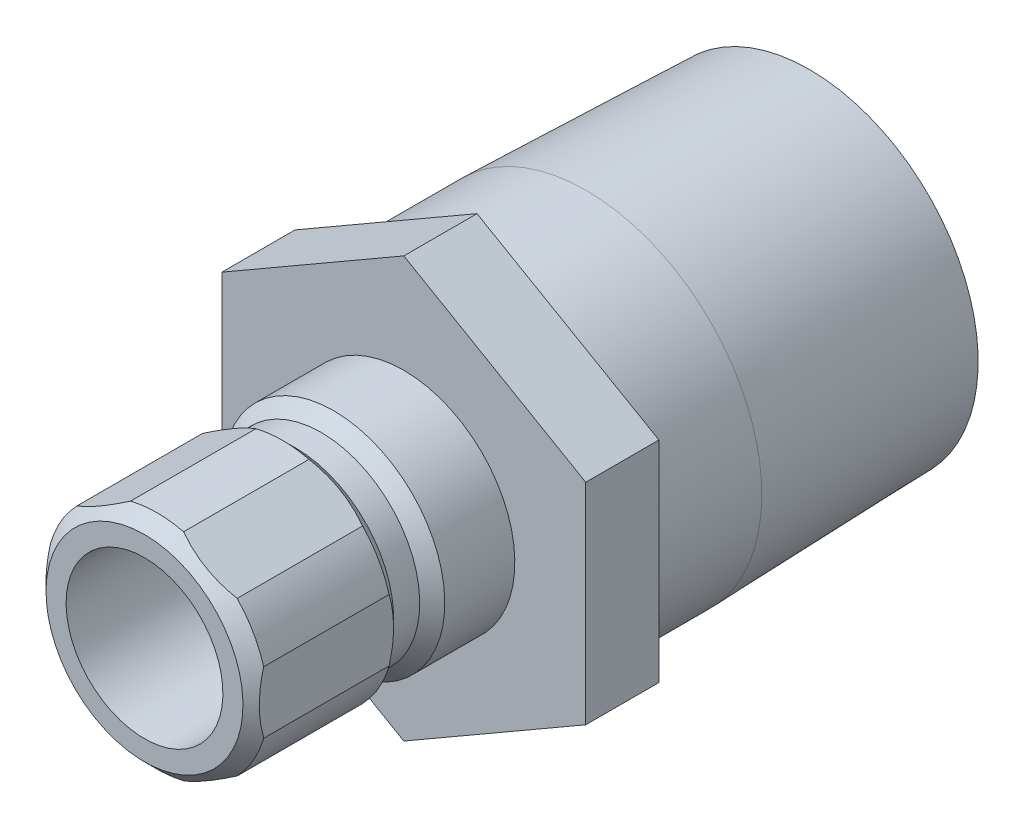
ISO-10303-21;
HEADER;
FILE_DESCRIPTION(('STEP AP214'),'2;1');
FILE_NAME('part.step','',(''),(''),'','','');
FILE_SCHEMA(('AUTOMOTIVE_DESIGN { 1 0 10303 214 1 1 1 1 }'));
ENDSEC;
DATA;
#1=APPLICATION_CONTEXT('core data for automotive mechanical design processes');
#2=APPLICATION_PROTOCOL_DEFINITION('international standard','automotive_design',2000,#1);
#3=PRODUCT_CONTEXT('',#1,'mechanical');
#4=PRODUCT('Part','Part','',(#3));
#5=PRODUCT_RELATED_PRODUCT_CATEGORY('part','',(#4));
#6=PRODUCT_DEFINITION_FORMATION('','',#4);
#7=PRODUCT_DEFINITION_CONTEXT('part definition',#1,'design');
#8=PRODUCT_DEFINITION('design','',#6,#7);
#9=PRODUCT_DEFINITION_SHAPE('','',#8);
#10=(LENGTH_UNIT() NAMED_UNIT(*) SI_UNIT(.MILLI.,.METRE.));
#11=(NAMED_UNIT(*) PLANE_ANGLE_UNIT() SI_UNIT($,.RADIAN.));
#12=(NAMED_UNIT(*) SI_UNIT($,.STERADIAN.) SOLID_ANGLE_UNIT());
#13=UNCERTAINTY_MEASURE_WITH_UNIT(LENGTH_MEASURE(1.E-05),#10,'distance_accuracy_value','');
#14=(GEOMETRIC_REPRESENTATION_CONTEXT(3) GLOBAL_UNCERTAINTY_ASSIGNED_CONTEXT((#13)) GLOBAL_UNIT_ASSIGNED_CONTEXT((#10,
#11,#12)) REPRESENTATION_CONTEXT('',''));
#15=CARTESIAN_POINT('',(0.,0.,0.));
#16=DIRECTION('',(0.,0.,1.));
#17=DIRECTION('',(1.,0.,0.));
#18=AXIS2_PLACEMENT_3D('',#15,#16,#17);
#19=CARTESIAN_POINT('',(0.,0.,0.));
#20=DIRECTION('',(0.,0.,-1.));
#21=DIRECTION('',(0.,1.,0.));
#22=AXIS2_PLACEMENT_3D('',#19,#20,#21);
#23=CYLINDRICAL_SURFACE('',#22,6.7437);
#24=DIRECTION('',(0.,0.,-1.));
#25=VECTOR('',#24,1.);
#26=CARTESIAN_POINT('',(-4.86468280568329,4.67036945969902,0.));
#27=LINE('',#26,#25);
#28=CARTESIAN_POINT('',(-4.86468280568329,4.67036945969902,7.36599999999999));
#29=VERTEX_POINT('',#28);
#30=CARTESIAN_POINT('',(-4.86468280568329,4.67036945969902,14.986));
#31=VERTEX_POINT('',#30);
#32=EDGE_CURVE('E526',#29,#31,#27,.F.);
#33=ORIENTED_EDGE('',*,*,#32,.F.);
#34=CARTESIAN_POINT('',(0.,0.,7.36599999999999));
#35=DIRECTION('',(0.,0.,-1.));
#36=DIRECTION('',(0.,1.,0.));
#37=AXIS2_PLACEMENT_3D('',#34,#35,#36);
#38=CIRCLE('',#37,6.7437);
#39=CARTESIAN_POINT('',(-6.477,1.87775416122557,7.36599999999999));
#40=VERTEX_POINT('',#39);
#41=EDGE_CURVE('E188',#40,#29,#38,.T.);
#42=ORIENTED_EDGE('',*,*,#41,.F.);
#43=DIRECTION('',(0.,0.,-1.));
#44=VECTOR('',#43,1.);
#45=CARTESIAN_POINT('',(-6.477,1.87775416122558,0.));
#46=LINE('',#45,#44);
#47=CARTESIAN_POINT('',(-6.477,1.87775416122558,14.986));
#48=VERTEX_POINT('',#47);
#49=EDGE_CURVE('E61',#48,#40,#46,.T.);
#50=ORIENTED_EDGE('',*,*,#49,.F.);
#51=CARTESIAN_POINT('',(0.,0.,14.986));
#52=DIRECTION('',(0.,0.,-1.));
#53=DIRECTION('',(0.,1.,0.));
#54=AXIS2_PLACEMENT_3D('',#51,#52,#53);
#55=CIRCLE('',#54,6.7437);
#56=EDGE_CURVE('E199',#48,#31,#55,.T.);
#57=ORIENTED_EDGE('',*,*,#56,.T.);
#58=EDGE_LOOP('',(#33,#42,#50,#57));
#59=FACE_BOUND('',#58,.T.);
#60=ADVANCED_FACE('F34',(#59),#23,.T.);
#61=DIRECTION('',(0.,0.,-1.));
#62=VECTOR('',#61,1.);
#63=CARTESIAN_POINT('',(-6.477,-1.87775416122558,0.));
#64=LINE('',#63,#62);
#65=CARTESIAN_POINT('',(-6.477,-1.87775416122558,7.36599999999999));
#66=VERTEX_POINT('',#65);
#67=CARTESIAN_POINT('',(-6.477,-1.87775416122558,14.986));
#68=VERTEX_POINT('',#67);
#69=EDGE_CURVE('E219',#66,#68,#64,.F.);
#70=ORIENTED_EDGE('',*,*,#69,.F.);
#71=CARTESIAN_POINT('',(-4.86468280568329,-4.67036945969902,7.36599999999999));
#72=VERTEX_POINT('',#71);
#73=EDGE_CURVE('E192',#72,#66,#38,.T.);
#74=ORIENTED_EDGE('',*,*,#73,.F.);
#75=DIRECTION('',(0.,0.,-1.));
#76=VECTOR('',#75,1.);
#77=CARTESIAN_POINT('',(-4.86468280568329,-4.67036945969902,0.));
#78=LINE('',#77,#76);
#79=CARTESIAN_POINT('',(-4.86468280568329,-4.67036945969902,14.986));
#80=VERTEX_POINT('',#79);
#81=EDGE_CURVE('E217',#80,#72,#78,.T.);
#82=ORIENTED_EDGE('',*,*,#81,.F.);
#83=EDGE_CURVE('E220',#80,#68,#55,.T.);
#84=ORIENTED_EDGE('',*,*,#83,.T.);
#85=EDGE_LOOP('',(#70,#74,#82,#84));
#86=FACE_BOUND('',#85,.T.);
#87=ADVANCED_FACE('F215',(#86),#23,.T.);
#88=DIRECTION('',(0.,0.,-1.));
#89=VECTOR('',#88,1.);
#90=CARTESIAN_POINT('',(-1.61231719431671,-6.5481236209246,0.));
#91=LINE('',#90,#89);
#92=CARTESIAN_POINT('',(-1.61231719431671,-6.5481236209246,7.36599999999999));
#93=VERTEX_POINT('',#92);
#94=CARTESIAN_POINT('',(-1.61231719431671,-6.5481236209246,14.986));
#95=VERTEX_POINT('',#94);
#96=EDGE_CURVE('E298',#93,#95,#91,.F.);
#97=ORIENTED_EDGE('',*,*,#96,.F.);
#98=CARTESIAN_POINT('',(1.61231719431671,-6.5481236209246,7.36599999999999));
#99=VERTEX_POINT('',#98);
#100=EDGE_CURVE('E202',#99,#93,#38,.T.);
#101=ORIENTED_EDGE('',*,*,#100,.F.);
#102=DIRECTION('',(0.,0.,-1.));
#103=VECTOR('',#102,1.);
#104=CARTESIAN_POINT('',(1.61231719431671,-6.5481236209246,0.));
#105=LINE('',#104,#103);
#106=CARTESIAN_POINT('',(1.61231719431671,-6.5481236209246,14.986));
#107=VERTEX_POINT('',#106);
#108=EDGE_CURVE('E315',#107,#99,#105,.T.);
#109=ORIENTED_EDGE('',*,*,#108,.F.);
#110=EDGE_CURVE('E311',#107,#95,#55,.T.);
#111=ORIENTED_EDGE('',*,*,#110,.T.);
#112=EDGE_LOOP('',(#97,#101,#109,#111));
#113=FACE_BOUND('',#112,.T.);
#114=ADVANCED_FACE('F314',(#113),#23,.T.);
#115=DIRECTION('',(0.,0.,-1.));
#116=VECTOR('',#115,1.);
#117=CARTESIAN_POINT('',(4.8646828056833,-4.67036945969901,0.));
#118=LINE('',#117,#116);
#119=CARTESIAN_POINT('',(4.8646828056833,-4.67036945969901,7.36599999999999));
#120=VERTEX_POINT('',#119);
#121=CARTESIAN_POINT('',(4.8646828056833,-4.67036945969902,14.986));
#122=VERTEX_POINT('',#121);
#123=EDGE_CURVE('E295',#120,#122,#118,.F.);
#124=ORIENTED_EDGE('',*,*,#123,.F.);
#125=CARTESIAN_POINT('',(6.477,-1.87775416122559,7.36599999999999));
#126=VERTEX_POINT('',#125);
#127=EDGE_CURVE('E197',#126,#120,#38,.T.);
#128=ORIENTED_EDGE('',*,*,#127,.F.);
#129=DIRECTION('',(0.,0.,-1.));
#130=VECTOR('',#129,1.);
#131=CARTESIAN_POINT('',(6.477,-1.8777541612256,0.));
#132=LINE('',#131,#130);
#133=CARTESIAN_POINT('',(6.477,-1.8777541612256,14.986));
#134=VERTEX_POINT('',#133);
#135=EDGE_CURVE('E362',#134,#126,#132,.T.);
#136=ORIENTED_EDGE('',*,*,#135,.F.);
#137=EDGE_CURVE('E316',#134,#122,#55,.T.);
#138=ORIENTED_EDGE('',*,*,#137,.T.);
#139=EDGE_LOOP('',(#124,#128,#136,#138));
#140=FACE_BOUND('',#139,.T.);
#141=ADVANCED_FACE('F349',(#140),#23,.T.);
#142=DIRECTION('',(0.,0.,-1.));
#143=VECTOR('',#142,1.);
#144=CARTESIAN_POINT('',(6.477,1.8777541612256,0.));
#145=LINE('',#144,#143);
#146=CARTESIAN_POINT('',(6.477,1.87775416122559,7.36599999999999));
#147=VERTEX_POINT('',#146);
#148=CARTESIAN_POINT('',(6.477,1.87775416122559,14.986));
#149=VERTEX_POINT('',#148);
#150=EDGE_CURVE('E357',#147,#149,#145,.F.);
#151=ORIENTED_EDGE('',*,*,#150,.F.);
#152=CARTESIAN_POINT('',(4.86468280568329,4.67036945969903,7.36599999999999));
#153=VERTEX_POINT('',#152);
#154=EDGE_CURVE('E191',#153,#147,#38,.T.);
#155=ORIENTED_EDGE('',*,*,#154,.F.);
#156=DIRECTION('',(0.,0.,-1.));
#157=VECTOR('',#156,1.);
#158=CARTESIAN_POINT('',(4.86468280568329,4.67036945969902,0.));
#159=LINE('',#158,#157);
#160=CARTESIAN_POINT('',(4.86468280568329,4.67036945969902,14.986));
#161=VERTEX_POINT('',#160);
#162=EDGE_CURVE('E168',#161,#153,#159,.T.);
#163=ORIENTED_EDGE('',*,*,#162,.F.);
#164=EDGE_CURVE('E200',#161,#149,#55,.T.);
#165=ORIENTED_EDGE('',*,*,#164,.T.);
#166=EDGE_LOOP('',(#151,#155,#163,#165));
#167=FACE_BOUND('',#166,.T.);
#168=ADVANCED_FACE('F334',(#167),#23,.T.);
#169=CARTESIAN_POINT('',(0.,0.,0.));
#170=DIRECTION('',(0.,0.,-1.));
#171=DIRECTION('',(0.,1.,0.));
#172=AXIS2_PLACEMENT_3D('',#169,#170,#171);
#173=CYLINDRICAL_SURFACE('',#172,10.668);
#174=CARTESIAN_POINT('',(0.,0.,-11.0744));
#175=DIRECTION('',(0.,0.,-1.));
#176=DIRECTION('',(0.,1.,0.));
#177=AXIS2_PLACEMENT_3D('',#174,#175,#176);
#178=CIRCLE('',#177,10.668);
#179=CARTESIAN_POINT('',(0.,10.668,-11.0744));
#180=VERTEX_POINT('',#179);
#181=EDGE_CURVE('E455',#180,#180,#178,.T.);
#182=ORIENTED_EDGE('',*,*,#181,.F.);
#183=EDGE_LOOP('',(#182));
#184=FACE_BOUND('',#183,.T.);
#185=CARTESIAN_POINT('',(0.,0.,-4.445));
#186=DIRECTION('',(0.,0.,1.));
#187=DIRECTION('',(1.,0.,0.));
#188=AXIS2_PLACEMENT_3D('',#185,#186,#187);
#189=CIRCLE('',#188,10.668);
#190=CARTESIAN_POINT('',(10.668,0.,-4.445));
#191=VERTEX_POINT('',#190);
#192=EDGE_CURVE('E471',#191,#191,#189,.F.);
#193=ORIENTED_EDGE('',*,*,#192,.T.);
#194=EDGE_LOOP('',(#193));
#195=FACE_BOUND('',#194,.T.);
#196=ADVANCED_FACE('F328',(#184,#195),#173,.T.);
#197=CARTESIAN_POINT('',(0.,0.,0.));
#198=DIRECTION('',(0.,0.,-1.));
#199=DIRECTION('',(0.,1.,0.));
#200=AXIS2_PLACEMENT_3D('',#197,#198,#199);
#201=CYLINDRICAL_SURFACE('',#200,4.7625);
#202=CARTESIAN_POINT('',(0.,0.,-1.524));
#203=DIRECTION('',(0.,0.,-1.));
#204=DIRECTION('',(0.,1.,0.));
#205=AXIS2_PLACEMENT_3D('',#202,#203,#204);
#206=CIRCLE('',#205,4.7625);
#207=CARTESIAN_POINT('',(0.,4.7625,-1.524));
#208=VERTEX_POINT('',#207);
#209=EDGE_CURVE('E469',#208,#208,#206,.T.);
#210=ORIENTED_EDGE('',*,*,#209,.T.);
#211=EDGE_LOOP('',(#210));
#212=FACE_BOUND('',#211,.T.);
#213=CARTESIAN_POINT('',(0.,0.,15.748));
#214=DIRECTION('',(0.,0.,-1.));
#215=DIRECTION('',(0.,1.,0.));
#216=AXIS2_PLACEMENT_3D('',#213,#214,#215);
#217=CIRCLE('',#216,4.7625);
#218=CARTESIAN_POINT('',(0.,4.7625,15.748));
#219=VERTEX_POINT('',#218);
#220=EDGE_CURVE('E174',#219,#219,#217,.T.);
#221=ORIENTED_EDGE('',*,*,#220,.F.);
#222=EDGE_LOOP('',(#221));
#223=FACE_BOUND('',#222,.T.);
#224=ADVANCED_FACE('F36',(#212,#223),#201,.F.);
#225=CARTESIAN_POINT('',(0.,4.7625,15.748));
#226=DIRECTION('',(0.,0.,1.));
#227=DIRECTION('',(0.,-1.,0.));
#228=AXIS2_PLACEMENT_3D('',#225,#226,#227);
#229=PLANE('',#228);
#230=ORIENTED_EDGE('',*,*,#220,.T.);
#231=EDGE_LOOP('',(#230));
#232=FACE_BOUND('',#231,.T.);
#233=CARTESIAN_POINT('',(0.,0.,15.748));
#234=DIRECTION('',(0.,0.,-1.));
#235=DIRECTION('',(0.,1.,0.));
#236=AXIS2_PLACEMENT_3D('',#233,#234,#235);
#237=CIRCLE('',#236,5.9817);
#238=CARTESIAN_POINT('',(0.,5.9817,15.748));
#239=VERTEX_POINT('',#238);
#240=EDGE_CURVE('E319',#239,#239,#237,.T.);
#241=ORIENTED_EDGE('',*,*,#240,.F.);
#242=EDGE_LOOP('',(#241));
#243=FACE_BOUND('',#242,.T.);
#244=ADVANCED_FACE('F324',(#232,#243),#229,.T.);
#245=CARTESIAN_POINT('',(0.,0.,14.986));
#246=DIRECTION('',(0.,0.,-1.));
#247=DIRECTION('',(0.,1.,0.));
#248=AXIS2_PLACEMENT_3D('',#245,#246,#247);
#249=CONICAL_SURFACE('',#248,6.7437,0.785398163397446);
#250=CARTESIAN_POINT('',(-4.86530473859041,4.67001038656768,14.9858));
#251=CARTESIAN_POINT('',(-4.72486305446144,4.75109443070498,15.0310202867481));
#252=CARTESIAN_POINT('',(-4.58312979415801,4.83292416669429,15.0711660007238));
#253=CARTESIAN_POINT('',(-4.29751110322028,4.99782619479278,15.1402365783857));
#254=CARTESIAN_POINT('',(-4.15362394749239,5.0808994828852,15.1691518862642));
#255=CARTESIAN_POINT('',(-3.8673393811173,5.2461859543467,15.2141425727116));
#256=CARTESIAN_POINT('',(-3.7249720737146,5.32838175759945,15.2304694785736));
#257=CARTESIAN_POINT('',(-3.43963286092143,5.49312242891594,15.2506210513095));
#258=CARTESIAN_POINT('',(-3.29666126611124,5.57566711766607,15.2544515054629));
#259=CARTESIAN_POINT('',(-3.02472390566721,5.73267022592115,15.2497120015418));
#260=CARTESIAN_POINT('',(-2.89574173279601,5.807138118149,15.2423062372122));
#261=CARTESIAN_POINT('',(-2.63846984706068,5.95567411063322,15.2174303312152));
#262=CARTESIAN_POINT('',(-2.51018036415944,6.02974207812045,15.1999570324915));
#263=CARTESIAN_POINT('',(-2.25244237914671,6.17854717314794,15.1550584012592));
#264=CARTESIAN_POINT('',(-2.1230180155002,6.25327036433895,15.1274506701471));
#265=CARTESIAN_POINT('',(-1.86594955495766,6.40168890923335,15.0631944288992));
#266=CARTESIAN_POINT('',(-1.73830430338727,6.47538492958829,15.026552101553));
#267=CARTESIAN_POINT('',(-1.61169526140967,6.5484826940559,14.9858));
#268=B_SPLINE_CURVE_WITH_KNOTS('',3,(#250,#251,#252,#253,#254,#255,#256,#257,#258,#259,#260,
#261,#262,#263,#264,#265,#266,#267),.UNSPECIFIED.,.F.,.F.,(4,2,2,2,2,2,2,2,4),(0.,
0.505093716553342,1.01061627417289,1.50575564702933,2.00066568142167,2.4476800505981,
2.89483467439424,3.35046683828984,3.80578805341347),.UNSPECIFIED.);
#269=CARTESIAN_POINT('',(-1.61231719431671,6.5481236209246,14.986));
#270=VERTEX_POINT('',#269);
#271=EDGE_CURVE('E506',#31,#270,#268,.T.);
#272=ORIENTED_EDGE('',*,*,#271,.F.);
#273=ORIENTED_EDGE('',*,*,#56,.F.);
#274=CARTESIAN_POINT('',(-6.477,-7.31595245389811,11.9585849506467));
#275=CARTESIAN_POINT('',(-6.477,-7.1371619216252,12.09242068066));
#276=CARTESIAN_POINT('',(-6.477,-6.95735466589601,12.2249205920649));
#277=CARTESIAN_POINT('',(-6.477,-6.59531185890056,12.4866559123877));
#278=CARTESIAN_POINT('',(-6.477,-6.41307569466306,12.6158904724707));
#279=CARTESIAN_POINT('',(-6.477,-6.04444818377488,12.8714195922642));
#280=CARTESIAN_POINT('',(-6.477,-5.85803557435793,12.9976835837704));
#281=CARTESIAN_POINT('',(-6.477,-5.48202253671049,13.245356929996));
#282=CARTESIAN_POINT('',(-6.477,-5.29242233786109,13.3667666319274));
#283=CARTESIAN_POINT('',(-6.477,-4.8990824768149,13.6101330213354));
#284=CARTESIAN_POINT('',(-6.477,-4.69513615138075,13.7317573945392));
#285=CARTESIAN_POINT('',(-6.477,-4.2824994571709,13.9668032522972));
#286=CARTESIAN_POINT('',(-6.477,-4.07380836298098,14.0802234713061));
#287=CARTESIAN_POINT('',(-6.477,-3.65173370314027,14.2964010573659));
#288=CARTESIAN_POINT('',(-6.477,-3.43836632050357,14.3991897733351));
#289=CARTESIAN_POINT('',(-6.477,-3.00590599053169,14.59180459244));
#290=CARTESIAN_POINT('',(-6.477,-2.78681563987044,14.6816364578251));
#291=CARTESIAN_POINT('',(-6.477,-2.35869152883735,14.8392509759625));
#292=CARTESIAN_POINT('',(-6.477,-2.15007621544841,14.9081583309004));
#293=CARTESIAN_POINT('',(-6.477,-1.72794730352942,15.029215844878));
#294=CARTESIAN_POINT('',(-6.477,-1.51443335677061,15.0813648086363));
#295=CARTESIAN_POINT('',(-6.477,-1.08726616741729,15.1653541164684));
#296=CARTESIAN_POINT('',(-6.477,-0.873680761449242,15.1975339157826));
#297=CARTESIAN_POINT('',(-6.477,-0.444382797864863,15.2409825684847));
#298=CARTESIAN_POINT('',(-6.477,-0.228670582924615,15.2522547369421));
#299=CARTESIAN_POINT('',(-6.477,0.195590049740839,15.2531049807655));
#300=CARTESIAN_POINT('',(-6.477,0.40413733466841,15.2433943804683));
#301=CARTESIAN_POINT('',(-6.477,0.819375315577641,15.2043531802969));
#302=CARTESIAN_POINT('',(-6.477,1.026065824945,15.1750206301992));
#303=CARTESIAN_POINT('',(-6.477,1.43958683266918,15.0978125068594));
#304=CARTESIAN_POINT('',(-6.477,1.64635839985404,15.0496261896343));
#305=CARTESIAN_POINT('',(-6.477,2.05541277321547,14.9372378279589));
#306=CARTESIAN_POINT('',(-6.477,2.25769600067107,14.8730372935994));
#307=CARTESIAN_POINT('',(-6.477,2.67942290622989,14.7234325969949));
#308=CARTESIAN_POINT('',(-6.477,2.89830973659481,14.6364736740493));
#309=CARTESIAN_POINT('',(-6.477,3.33036785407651,14.4492510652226));
#310=CARTESIAN_POINT('',(-6.477,3.5435363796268,14.3489810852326));
#311=CARTESIAN_POINT('',(-6.477,3.96521765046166,14.1375266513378));
#312=CARTESIAN_POINT('',(-6.477,4.17371291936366,14.026307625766));
#313=CARTESIAN_POINT('',(-6.477,4.58589470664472,13.7954185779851));
#314=CARTESIAN_POINT('',(-6.477,4.78958199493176,13.6757499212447));
#315=CARTESIAN_POINT('',(-6.477,5.18271200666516,13.4357848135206));
#316=CARTESIAN_POINT('',(-6.477,5.37235766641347,13.3158190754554));
#317=CARTESIAN_POINT('',(-6.477,5.74839484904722,13.0708760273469));
#318=CARTESIAN_POINT('',(-6.477,5.93478612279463,12.9458983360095));
#319=CARTESIAN_POINT('',(-6.477,6.30322303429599,12.6928680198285));
#320=CARTESIAN_POINT('',(-6.477,6.48529173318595,12.5648488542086));
#321=CARTESIAN_POINT('',(-6.477,6.84694630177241,12.3054498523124));
#322=CARTESIAN_POINT('',(-6.477,7.02653283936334,12.174070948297));
#323=CARTESIAN_POINT('',(-6.477,7.20508094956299,12.041319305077));
#324=B_SPLINE_CURVE_WITH_KNOTS('',3,(#274,#275,#276,#277,#278,#279,#280,#281,#282,#283,#284,
#285,#286,#287,#288,#289,#290,#291,#292,#293,#294,#295,#296,#297,#298,#299,#300,#301,#302,#303,
#304,#305,#306,#307,#308,#309,#310,#311,#312,#313,#314,#315,#316,#317,#318,#319,#320,#321,#322,
#323),.UNSPECIFIED.,.F.,.F.,(4,2,2,2,2,2,2,2,2,2,2,2,2,2,2,2,2,2,2,2,2,2,2,2,4),(0.,
0.670015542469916,1.34020350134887,2.01558827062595,2.69092464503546,3.40314702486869,
4.11547903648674,4.82564684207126,5.53549783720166,6.19401709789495,6.85258331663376,
7.49962373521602,8.14656155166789,8.77191276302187,9.39732613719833,10.0335138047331,
10.6696415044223,11.3756703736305,12.0820342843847,12.7907048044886,13.4992610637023,
14.1723809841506,14.845552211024,15.5132243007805,16.1807130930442),.UNSPECIFIED.);
#325=EDGE_CURVE('E222',#68,#48,#324,.T.);
#326=ORIENTED_EDGE('',*,*,#325,.F.);
#327=ORIENTED_EDGE('',*,*,#83,.F.);
#328=CARTESIAN_POINT('',(-1.61169526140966,-6.5484826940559,14.9858));
#329=CARTESIAN_POINT('',(-1.75213694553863,-6.4673986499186,15.0310202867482));
#330=CARTESIAN_POINT('',(-1.89387020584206,-6.38556891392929,15.0711660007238));
#331=CARTESIAN_POINT('',(-2.1794888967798,-6.2206668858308,15.1402365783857));
#332=CARTESIAN_POINT('',(-2.32337605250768,-6.13759359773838,15.1691518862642));
#333=CARTESIAN_POINT('',(-2.60966061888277,-5.97230712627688,15.2141425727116));
#334=CARTESIAN_POINT('',(-2.75202792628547,-5.89011132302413,15.2304694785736));
#335=CARTESIAN_POINT('',(-3.03736713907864,-5.72537065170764,15.2506210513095));
#336=CARTESIAN_POINT('',(-3.18033873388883,-5.64282596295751,15.2544515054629));
#337=CARTESIAN_POINT('',(-3.45227609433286,-5.48582285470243,15.2497120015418));
#338=CARTESIAN_POINT('',(-3.58125826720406,-5.41135496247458,15.2423062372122));
#339=CARTESIAN_POINT('',(-3.83853015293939,-5.26281896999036,15.2174303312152));
#340=CARTESIAN_POINT('',(-3.96681963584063,-5.18875100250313,15.1999570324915));
#341=CARTESIAN_POINT('',(-4.22455762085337,-5.03994590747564,15.1550584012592));
#342=CARTESIAN_POINT('',(-4.35398198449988,-4.96522271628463,15.1274506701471));
#343=CARTESIAN_POINT('',(-4.61105044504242,-4.81680417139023,15.0631944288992));
#344=CARTESIAN_POINT('',(-4.73869569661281,-4.74310815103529,15.026552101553));
#345=CARTESIAN_POINT('',(-4.86530473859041,-4.67001038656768,14.9858));
#346=B_SPLINE_CURVE_WITH_KNOTS('',3,(#328,#329,#330,#331,#332,#333,#334,#335,#336,#337,#338,
#339,#340,#341,#342,#343,#344,#345),.UNSPECIFIED.,.F.,.F.,(4,2,2,2,2,2,2,2,4),(0.,
0.505093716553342,1.01061627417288,1.50575564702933,2.00066568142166,2.44768005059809,
2.89483467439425,3.35046683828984,3.80578805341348),.UNSPECIFIED.);
#347=EDGE_CURVE('E225',#95,#80,#346,.T.);
#348=ORIENTED_EDGE('',*,*,#347,.F.);
#349=ORIENTED_EDGE('',*,*,#110,.F.);
#350=CARTESIAN_POINT('',(4.86530473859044,-4.67001038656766,14.9858));
#351=CARTESIAN_POINT('',(4.72486305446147,-4.75109443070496,15.0310202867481));
#352=CARTESIAN_POINT('',(4.58312979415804,-4.83292416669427,15.0711660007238));
#353=CARTESIAN_POINT('',(4.2975111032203,-4.99782619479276,15.1402365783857));
#354=CARTESIAN_POINT('',(4.15362394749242,-5.08089948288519,15.1691518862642));
#355=CARTESIAN_POINT('',(3.86733938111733,-5.24618595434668,15.2141425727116));
#356=CARTESIAN_POINT('',(3.72497207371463,-5.32838175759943,15.2304694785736));
#357=CARTESIAN_POINT('',(3.43963286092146,-5.49312242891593,15.2506210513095));
#358=CARTESIAN_POINT('',(3.29666126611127,-5.57566711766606,15.2544515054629));
#359=CARTESIAN_POINT('',(3.0247239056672,-5.73267022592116,15.2497120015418));
#360=CARTESIAN_POINT('',(2.89574173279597,-5.80713811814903,15.2423062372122));
#361=CARTESIAN_POINT('',(2.63846984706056,-5.95567411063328,15.2174303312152));
#362=CARTESIAN_POINT('',(2.51018036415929,-6.02974207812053,15.1999570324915));
#363=CARTESIAN_POINT('',(2.25244237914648,-6.17854717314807,15.1550584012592));
#364=CARTESIAN_POINT('',(2.12301801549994,-6.2532703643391,15.127450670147));
#365=CARTESIAN_POINT('',(1.86594955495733,-6.40168890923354,15.0631944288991));
#366=CARTESIAN_POINT('',(1.73830430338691,-6.4753849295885,15.0265521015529));
#367=CARTESIAN_POINT('',(1.61169526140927,-6.54848269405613,14.9857999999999));
#368=B_SPLINE_CURVE_WITH_KNOTS('',3,(#350,#351,#352,#353,#354,#355,#356,#357,#358,#359,#360,
#361,#362,#363,#364,#365,#366,#367),.UNSPECIFIED.,.F.,.F.,(4,2,2,2,2,2,2,2,4),(0.,
0.505093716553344,1.01061627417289,1.50575564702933,2.00066568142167,2.44768005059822,
2.89483467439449,3.35046683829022,3.80578805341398),.UNSPECIFIED.);
#369=EDGE_CURVE('E289',#122,#107,#368,.T.);
#370=ORIENTED_EDGE('',*,*,#369,.F.);
#371=ORIENTED_EDGE('',*,*,#137,.F.);
#372=CARTESIAN_POINT('',(6.477,-7.31595245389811,11.9585849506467));
#373=CARTESIAN_POINT('',(6.477,-7.1371619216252,12.09242068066));
#374=CARTESIAN_POINT('',(6.477,-6.957354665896,12.2249205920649));
#375=CARTESIAN_POINT('',(6.477,-6.59531185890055,12.4866559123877));
#376=CARTESIAN_POINT('',(6.477,-6.41307569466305,12.6158904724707));
#377=CARTESIAN_POINT('',(6.477,-6.04444818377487,12.8714195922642));
#378=CARTESIAN_POINT('',(6.477,-5.85803557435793,12.9976835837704));
#379=CARTESIAN_POINT('',(6.477,-5.48202253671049,13.245356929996));
#380=CARTESIAN_POINT('',(6.477,-5.29242233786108,13.3667666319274));
#381=CARTESIAN_POINT('',(6.477,-4.8990824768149,13.6101330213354));
#382=CARTESIAN_POINT('',(6.477,-4.69513615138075,13.7317573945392));
#383=CARTESIAN_POINT('',(6.477,-4.28249945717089,13.9668032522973));
#384=CARTESIAN_POINT('',(6.477,-4.07380836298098,14.0802234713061));
#385=CARTESIAN_POINT('',(6.477,-3.65173370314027,14.2964010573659));
#386=CARTESIAN_POINT('',(6.477,-3.43836632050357,14.3991897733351));
#387=CARTESIAN_POINT('',(6.477,-3.00590599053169,14.59180459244));
#388=CARTESIAN_POINT('',(6.477,-2.78681563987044,14.6816364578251));
#389=CARTESIAN_POINT('',(6.477,-2.35869152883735,14.8392509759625));
#390=CARTESIAN_POINT('',(6.477,-2.15007621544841,14.9081583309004));
#391=CARTESIAN_POINT('',(6.477,-1.72794730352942,15.029215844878));
#392=CARTESIAN_POINT('',(6.477,-1.51443335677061,15.0813648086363));
#393=CARTESIAN_POINT('',(6.477,-1.08726616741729,15.1653541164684));
#394=CARTESIAN_POINT('',(6.477,-0.873680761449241,15.1975339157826));
#395=CARTESIAN_POINT('',(6.477,-0.444382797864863,15.2409825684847));
#396=CARTESIAN_POINT('',(6.477,-0.228670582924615,15.2522547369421));
#397=CARTESIAN_POINT('',(6.477,0.195590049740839,15.2531049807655));
#398=CARTESIAN_POINT('',(6.477,0.404137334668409,15.2433943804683));
#399=CARTESIAN_POINT('',(6.477,0.81937531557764,15.2043531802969));
#400=CARTESIAN_POINT('',(6.477,1.026065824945,15.1750206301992));
#401=CARTESIAN_POINT('',(6.477,1.43958683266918,15.0978125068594));
#402=CARTESIAN_POINT('',(6.477,1.64635839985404,15.0496261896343));
#403=CARTESIAN_POINT('',(6.477,2.05541277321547,14.937237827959));
#404=CARTESIAN_POINT('',(6.477,2.25769600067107,14.8730372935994));
#405=CARTESIAN_POINT('',(6.477,2.67942290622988,14.7234325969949));
#406=CARTESIAN_POINT('',(6.477,2.8983097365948,14.6364736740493));
#407=CARTESIAN_POINT('',(6.477,3.33036785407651,14.4492510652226));
#408=CARTESIAN_POINT('',(6.477,3.5435363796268,14.3489810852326));
#409=CARTESIAN_POINT('',(6.477,3.96521765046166,14.1375266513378));
#410=CARTESIAN_POINT('',(6.477,4.17371291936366,14.026307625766));
#411=CARTESIAN_POINT('',(6.477,4.58589470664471,13.7954185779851));
#412=CARTESIAN_POINT('',(6.477,4.78958199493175,13.6757499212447));
#413=CARTESIAN_POINT('',(6.477,5.18271200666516,13.4357848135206));
#414=CARTESIAN_POINT('',(6.477,5.37235766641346,13.3158190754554));
#415=CARTESIAN_POINT('',(6.477,5.74839484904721,13.0708760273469));
#416=CARTESIAN_POINT('',(6.477,5.93478612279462,12.9458983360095));
#417=CARTESIAN_POINT('',(6.477,6.30322303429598,12.6928680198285));
#418=CARTESIAN_POINT('',(6.477,6.48529173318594,12.5648488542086));
#419=CARTESIAN_POINT('',(6.477,6.8469463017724,12.3054498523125));
#420=CARTESIAN_POINT('',(6.477,7.02653283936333,12.174070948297));
#421=CARTESIAN_POINT('',(6.477,7.20508094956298,12.041319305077));
#422=B_SPLINE_CURVE_WITH_KNOTS('',3,(#372,#373,#374,#375,#376,#377,#378,#379,#380,#381,#382,
#383,#384,#385,#386,#387,#388,#389,#390,#391,#392,#393,#394,#395,#396,#397,#398,#399,#400,#401,
#402,#403,#404,#405,#406,#407,#408,#409,#410,#411,#412,#413,#414,#415,#416,#417,#418,#419,#420,
#421),.UNSPECIFIED.,.F.,.F.,(4,2,2,2,2,2,2,2,2,2,2,2,2,2,2,2,2,2,2,2,2,2,2,2,4),(0.,
0.670015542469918,1.34020350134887,2.01558827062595,2.69092464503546,3.40314702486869,
4.11547903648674,4.82564684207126,5.53549783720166,6.19401709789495,6.85258331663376,
7.49962373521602,8.14656155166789,8.77191276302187,9.39732613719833,10.0335138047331,
10.6696415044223,11.3756703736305,12.0820342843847,12.7907048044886,13.4992610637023,
14.1723809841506,14.845552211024,15.5132243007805,16.1807130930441),.UNSPECIFIED.);
#423=EDGE_CURVE('E361',#149,#134,#422,.F.);
#424=ORIENTED_EDGE('',*,*,#423,.F.);
#425=ORIENTED_EDGE('',*,*,#164,.F.);
#426=CARTESIAN_POINT('',(1.61169526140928,6.54848269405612,14.9857999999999));
#427=CARTESIAN_POINT('',(1.75213694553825,6.46739864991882,15.031020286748));
#428=CARTESIAN_POINT('',(1.89387020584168,6.38556891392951,15.0711660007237));
#429=CARTESIAN_POINT('',(2.17948889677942,6.22066688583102,15.1402365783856));
#430=CARTESIAN_POINT('',(2.3233760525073,6.1375935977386,15.1691518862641));
#431=CARTESIAN_POINT('',(2.60966061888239,5.9723071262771,15.2141425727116));
#432=CARTESIAN_POINT('',(2.75202792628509,5.89011132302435,15.2304694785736));
#433=CARTESIAN_POINT('',(3.03736713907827,5.72537065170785,15.2506210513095));
#434=CARTESIAN_POINT('',(3.18033873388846,5.64282596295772,15.2544515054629));
#435=CARTESIAN_POINT('',(3.45227609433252,5.48582285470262,15.2497120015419));
#436=CARTESIAN_POINT('',(3.58125826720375,5.41135496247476,15.2423062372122));
#437=CARTESIAN_POINT('',(3.83853015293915,5.2628189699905,15.2174303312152));
#438=CARTESIAN_POINT('',(3.96681963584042,5.18875100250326,15.1999570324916));
#439=CARTESIAN_POINT('',(4.22455762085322,5.03994590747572,15.1550584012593));
#440=CARTESIAN_POINT('',(4.35398198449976,4.9652227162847,15.1274506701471));
#441=CARTESIAN_POINT('',(4.61105044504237,4.81680417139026,15.0631944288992));
#442=CARTESIAN_POINT('',(4.73869569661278,4.7431081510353,15.026552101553));
#443=CARTESIAN_POINT('',(4.86530473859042,4.67001038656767,14.9858));
#444=B_SPLINE_CURVE_WITH_KNOTS('',3,(#426,#427,#428,#429,#430,#431,#432,#433,#434,#435,#436,
#437,#438,#439,#440,#441,#442,#443),.UNSPECIFIED.,.F.,.F.,(4,2,2,2,2,2,2,2,4),(0.,
0.505093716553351,1.0106162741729,1.50575564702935,2.0006656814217,2.44768005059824,
2.89483467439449,3.3504668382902,3.80578805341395),.UNSPECIFIED.);
#445=CARTESIAN_POINT('',(1.61231719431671,6.5481236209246,14.986));
#446=VERTEX_POINT('',#445);
#447=EDGE_CURVE('E183',#446,#161,#444,.T.);
#448=ORIENTED_EDGE('',*,*,#447,.F.);
#449=EDGE_CURVE('E182',#270,#446,#55,.T.);
#450=ORIENTED_EDGE('',*,*,#449,.F.);
#451=EDGE_LOOP('',(#272,#273,#326,#327,#348,#349,#370,#371,#424,#425,#448,#450));
#452=FACE_BOUND('',#451,.T.);
#453=ORIENTED_EDGE('',*,*,#240,.T.);
#454=EDGE_LOOP('',(#453));
#455=FACE_BOUND('',#454,.T.);
#456=ADVANCED_FACE('F235',(#452,#455),#249,.T.);
#457=DIRECTION('',(0.,0.,-1.));
#458=VECTOR('',#457,1.);
#459=CARTESIAN_POINT('',(-1.61231719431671,6.5481236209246,0.));
#460=LINE('',#459,#458);
#461=CARTESIAN_POINT('',(-1.61231719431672,6.5481236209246,7.36599999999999));
#462=VERTEX_POINT('',#461);
#463=EDGE_CURVE('E53',#270,#462,#460,.T.);
#464=ORIENTED_EDGE('',*,*,#463,.F.);
#465=ORIENTED_EDGE('',*,*,#449,.T.);
#466=DIRECTION('',(0.,0.,-1.));
#467=VECTOR('',#466,1.);
#468=CARTESIAN_POINT('',(1.61231719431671,6.5481236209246,0.));
#469=LINE('',#468,#467);
#470=CARTESIAN_POINT('',(1.61231719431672,6.5481236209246,7.36599999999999));
#471=VERTEX_POINT('',#470);
#472=EDGE_CURVE('E165',#471,#446,#469,.F.);
#473=ORIENTED_EDGE('',*,*,#472,.F.);
#474=EDGE_CURVE('E180',#462,#471,#38,.T.);
#475=ORIENTED_EDGE('',*,*,#474,.F.);
#476=EDGE_LOOP('',(#464,#465,#473,#475));
#477=FACE_BOUND('',#476,.T.);
#478=ADVANCED_FACE('F179',(#477),#23,.T.);
#479=CARTESIAN_POINT('',(0.,0.,6.604));
#480=DIRECTION('',(0.,0.,1.));
#481=DIRECTION('',(0.,-1.,0.));
#482=AXIS2_PLACEMENT_3D('',#479,#480,#481);
#483=CONICAL_SURFACE('',#482,5.9817,0.785398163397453);
#484=CARTESIAN_POINT('',(-1.61169526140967,6.5484826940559,7.36619999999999));
#485=CARTESIAN_POINT('',(-1.75213694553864,6.46739864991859,7.32097971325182));
#486=CARTESIAN_POINT('',(-1.89387020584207,6.38556891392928,7.2808339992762));
#487=CARTESIAN_POINT('',(-2.1794888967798,6.2206668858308,7.21176342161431));
#488=CARTESIAN_POINT('',(-2.32337605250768,6.13759359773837,7.18284811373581));
#489=CARTESIAN_POINT('',(-2.60966061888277,5.97230712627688,7.13785742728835));
#490=CARTESIAN_POINT('',(-2.75202792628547,5.89011132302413,7.12153052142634));
#491=CARTESIAN_POINT('',(-3.03736713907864,5.72537065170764,7.10137894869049));
#492=CARTESIAN_POINT('',(-3.18033873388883,5.64282596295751,7.09754849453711));
#493=CARTESIAN_POINT('',(-3.45227609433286,5.48582285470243,7.10228799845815));
#494=CARTESIAN_POINT('',(-3.58125826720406,5.41135496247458,7.10969376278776));
#495=CARTESIAN_POINT('',(-3.83853015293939,5.26281896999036,7.13456966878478));
#496=CARTESIAN_POINT('',(-3.96681963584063,5.18875100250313,7.15204296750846));
#497=CARTESIAN_POINT('',(-4.22455762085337,5.03994590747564,7.19694159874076));
#498=CARTESIAN_POINT('',(-4.35398198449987,4.96522271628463,7.22454932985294));
#499=CARTESIAN_POINT('',(-4.61105044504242,4.81680417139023,7.2888055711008));
#500=CARTESIAN_POINT('',(-4.7386956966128,4.74310815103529,7.32544789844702));
#501=CARTESIAN_POINT('',(-4.86530473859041,4.67001038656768,7.36620000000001));
#502=B_SPLINE_CURVE_WITH_KNOTS('',3,(#484,#485,#486,#487,#488,#489,#490,#491,#492,#493,#494,
#495,#496,#497,#498,#499,#500,#501),.UNSPECIFIED.,.F.,.F.,(4,2,2,2,2,2,2,2,4),(0.,
0.50509371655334,1.01061627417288,1.50575564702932,2.00066568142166,2.44768005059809,
2.89483467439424,3.35046683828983,3.80578805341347),.UNSPECIFIED.);
#503=EDGE_CURVE('E12',#462,#29,#502,.T.);
#504=ORIENTED_EDGE('',*,*,#503,.F.);
#505=ORIENTED_EDGE('',*,*,#474,.T.);
#506=CARTESIAN_POINT('',(4.86530473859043,4.67001038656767,7.36620000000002));
#507=CARTESIAN_POINT('',(4.72486305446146,4.75109443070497,7.32097971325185));
#508=CARTESIAN_POINT('',(4.58312979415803,4.83292416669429,7.28083399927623));
#509=CARTESIAN_POINT('',(4.29751110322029,4.99782619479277,7.21176342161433));
#510=CARTESIAN_POINT('',(4.15362394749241,5.0808994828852,7.18284811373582));
#511=CARTESIAN_POINT('',(3.86733938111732,5.24618595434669,7.13785742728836));
#512=CARTESIAN_POINT('',(3.72497207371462,5.32838175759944,7.12153052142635));
#513=CARTESIAN_POINT('',(3.43963286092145,5.49312242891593,7.1013789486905));
#514=CARTESIAN_POINT('',(3.29666126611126,5.57566711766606,7.09754849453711));
#515=CARTESIAN_POINT('',(3.0247239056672,5.73267022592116,7.10228799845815));
#516=CARTESIAN_POINT('',(2.89574173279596,5.80713811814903,7.10969376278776));
#517=CARTESIAN_POINT('',(2.63846984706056,5.95567411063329,7.13456966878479));
#518=CARTESIAN_POINT('',(2.51018036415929,6.02974207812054,7.15204296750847));
#519=CARTESIAN_POINT('',(2.25244237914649,6.17854717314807,7.19694159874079));
#520=CARTESIAN_POINT('',(2.12301801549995,6.2532703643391,7.22454932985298));
#521=CARTESIAN_POINT('',(1.86594955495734,6.40168890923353,7.28880557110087));
#522=CARTESIAN_POINT('',(1.73830430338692,6.47538492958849,7.32544789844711));
#523=CARTESIAN_POINT('',(1.61169526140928,6.54848269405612,7.36620000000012));
#524=B_SPLINE_CURVE_WITH_KNOTS('',3,(#506,#507,#508,#509,#510,#511,#512,#513,#514,#515,#516,
#517,#518,#519,#520,#521,#522,#523),.UNSPECIFIED.,.F.,.F.,(4,2,2,2,2,2,2,2,4),(0.,
0.505093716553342,1.01061627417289,1.50575564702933,2.00066568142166,2.44768005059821,
2.89483467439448,3.35046683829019,3.80578805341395),.UNSPECIFIED.);
#525=EDGE_CURVE('E162',#153,#471,#524,.T.);
#526=ORIENTED_EDGE('',*,*,#525,.F.);
#527=ORIENTED_EDGE('',*,*,#154,.T.);
#528=CARTESIAN_POINT('',(6.477,-7.31595245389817,10.3934150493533));
#529=CARTESIAN_POINT('',(6.477,-7.13716192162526,10.25957931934));
#530=CARTESIAN_POINT('',(6.477,-6.95735466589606,10.1270794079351));
#531=CARTESIAN_POINT('',(6.477,-6.59531185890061,9.86534408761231));
#532=CARTESIAN_POINT('',(6.477,-6.41307569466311,9.7361095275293));
#533=CARTESIAN_POINT('',(6.477,-6.04444818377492,9.48058040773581));
#534=CARTESIAN_POINT('',(6.477,-5.85803557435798,9.35431641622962));
#535=CARTESIAN_POINT('',(6.477,-5.48202253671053,9.10664307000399));
#536=CARTESIAN_POINT('',(6.477,-5.29242233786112,8.98523336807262));
#537=CARTESIAN_POINT('',(6.477,-4.89908247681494,8.74186697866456));
#538=CARTESIAN_POINT('',(6.477,-4.69513615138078,8.62024260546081));
#539=CARTESIAN_POINT('',(6.477,-4.28249945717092,8.38519674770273));
#540=CARTESIAN_POINT('',(6.477,-4.073808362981,8.27177652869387));
#541=CARTESIAN_POINT('',(6.477,-3.65173370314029,8.05559894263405));
#542=CARTESIAN_POINT('',(6.477,-3.43836632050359,7.95281022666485));
#543=CARTESIAN_POINT('',(6.477,-3.00590599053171,7.76019540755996));
#544=CARTESIAN_POINT('',(6.477,-2.78681563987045,7.67036354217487));
#545=CARTESIAN_POINT('',(6.477,-2.35869152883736,7.51274902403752));
#546=CARTESIAN_POINT('',(6.477,-2.15007621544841,7.4438416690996));
#547=CARTESIAN_POINT('',(6.477,-1.72794730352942,7.32278415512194));
#548=CARTESIAN_POINT('',(6.477,-1.51443335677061,7.27063519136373));
#549=CARTESIAN_POINT('',(6.477,-1.08726616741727,7.18664588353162));
#550=CARTESIAN_POINT('',(6.477,-0.873680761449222,7.15446608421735));
#551=CARTESIAN_POINT('',(6.477,-0.444382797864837,7.1110174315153));
#552=CARTESIAN_POINT('',(6.477,-0.228670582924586,7.09974526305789));
#553=CARTESIAN_POINT('',(6.477,0.195590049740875,7.09889501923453));
#554=CARTESIAN_POINT('',(6.477,0.404137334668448,7.10860561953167));
#555=CARTESIAN_POINT('',(6.477,0.819375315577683,7.14764681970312));
#556=CARTESIAN_POINT('',(6.477,1.02606582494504,7.1769793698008));
#557=CARTESIAN_POINT('',(6.477,1.43958683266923,7.25418749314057));
#558=CARTESIAN_POINT('',(6.477,1.64635839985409,7.30237381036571));
#559=CARTESIAN_POINT('',(6.477,2.05541277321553,7.41476217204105));
#560=CARTESIAN_POINT('',(6.477,2.25769600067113,7.47896270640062));
#561=CARTESIAN_POINT('',(6.477,2.67942290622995,7.62856740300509));
#562=CARTESIAN_POINT('',(6.477,2.89830973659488,7.71552632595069));
#563=CARTESIAN_POINT('',(6.477,3.33036785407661,7.90274893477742));
#564=CARTESIAN_POINT('',(6.477,3.5435363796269,8.00301891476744));
#565=CARTESIAN_POINT('',(6.477,3.96521765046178,8.21447334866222));
#566=CARTESIAN_POINT('',(6.477,4.17371291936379,8.32569237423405));
#567=CARTESIAN_POINT('',(6.477,4.58589470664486,8.55658142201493));
#568=CARTESIAN_POINT('',(6.477,4.78958199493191,8.67625007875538));
#569=CARTESIAN_POINT('',(6.477,5.18271200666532,8.91621518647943));
#570=CARTESIAN_POINT('',(6.477,5.37235766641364,9.03618092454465));
#571=CARTESIAN_POINT('',(6.477,5.7483948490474,9.28112397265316));
#572=CARTESIAN_POINT('',(6.477,5.93478612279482,9.4061016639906));
#573=CARTESIAN_POINT('',(6.477,6.30322303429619,9.65913198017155));
#574=CARTESIAN_POINT('',(6.477,6.48529173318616,9.78715114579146));
#575=CARTESIAN_POINT('',(6.477,6.84694630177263,10.0465501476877));
#576=CARTESIAN_POINT('',(6.477,7.02653283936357,10.1779290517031));
#577=CARTESIAN_POINT('',(6.477,7.20508094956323,10.3106806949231));
#578=B_SPLINE_CURVE_WITH_KNOTS('',3,(#528,#529,#530,#531,#532,#533,#534,#535,#536,#537,#538,
#539,#540,#541,#542,#543,#544,#545,#546,#547,#548,#549,#550,#551,#552,#553,#554,#555,#556,#557,
#558,#559,#560,#561,#562,#563,#564,#565,#566,#567,#568,#569,#570,#571,#572,#573,#574,#575,#576,
#577),.UNSPECIFIED.,.F.,.F.,(4,2,2,2,2,2,2,2,2,2,2,2,2,2,2,2,2,2,2,2,2,2,2,2,4),(0.,
0.670015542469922,1.34020350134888,2.01558827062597,2.69092464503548,3.40314702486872,
4.11547903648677,4.8256468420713,5.53549783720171,6.19401709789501,6.85258331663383,
7.49962373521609,8.14656155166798,8.77191276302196,9.39732613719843,10.0335138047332,
10.6696415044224,11.3756703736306,12.0820342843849,12.7907048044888,13.4992610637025,
14.1723809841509,14.8455522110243,15.5132243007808,16.1807130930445),.UNSPECIFIED.);
#579=EDGE_CURVE('E173',#126,#147,#578,.T.);
#580=ORIENTED_EDGE('',*,*,#579,.F.);
#581=ORIENTED_EDGE('',*,*,#127,.T.);
#582=CARTESIAN_POINT('',(1.61169526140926,-6.54848269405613,7.36620000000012));
#583=CARTESIAN_POINT('',(1.75213694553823,-6.46739864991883,7.32097971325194));
#584=CARTESIAN_POINT('',(1.89387020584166,-6.38556891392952,7.28083399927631));
#585=CARTESIAN_POINT('',(2.17948889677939,-6.22066688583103,7.21176342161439));
#586=CARTESIAN_POINT('',(2.32337605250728,-6.13759359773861,7.18284811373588));
#587=CARTESIAN_POINT('',(2.60966061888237,-5.97230712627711,7.1378574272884));
#588=CARTESIAN_POINT('',(2.75202792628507,-5.89011132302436,7.12153052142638));
#589=CARTESIAN_POINT('',(3.03736713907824,-5.72537065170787,7.1013789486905));
#590=CARTESIAN_POINT('',(3.18033873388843,-5.64282596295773,7.09754849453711));
#591=CARTESIAN_POINT('',(3.4522760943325,-5.48582285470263,7.10228799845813));
#592=CARTESIAN_POINT('',(3.58125826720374,-5.41135496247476,7.10969376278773));
#593=CARTESIAN_POINT('',(3.83853015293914,-5.2628189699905,7.13456966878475));
#594=CARTESIAN_POINT('',(3.96681963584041,-5.18875100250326,7.15204296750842));
#595=CARTESIAN_POINT('',(4.22455762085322,-5.03994590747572,7.19694159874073));
#596=CARTESIAN_POINT('',(4.35398198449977,-4.96522271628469,7.22454932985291));
#597=CARTESIAN_POINT('',(4.61105044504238,-4.81680417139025,7.28880557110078));
#598=CARTESIAN_POINT('',(4.7386956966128,-4.74310815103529,7.32544789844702));
#599=CARTESIAN_POINT('',(4.86530473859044,-4.67001038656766,7.36620000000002));
#600=B_SPLINE_CURVE_WITH_KNOTS('',3,(#582,#583,#584,#585,#586,#587,#588,#589,#590,#591,#592,
#593,#594,#595,#596,#597,#598,#599),.UNSPECIFIED.,.F.,.F.,(4,2,2,2,2,2,2,2,4),(0.,
0.505093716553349,1.0106162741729,1.50575564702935,2.00066568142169,2.44768005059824,
2.89483467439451,3.35046683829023,3.80578805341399),.UNSPECIFIED.);
#601=EDGE_CURVE('E277',#99,#120,#600,.T.);
#602=ORIENTED_EDGE('',*,*,#601,.F.);
#603=ORIENTED_EDGE('',*,*,#100,.T.);
#604=CARTESIAN_POINT('',(-4.86530473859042,-4.67001038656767,7.36620000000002));
#605=CARTESIAN_POINT('',(-4.72486305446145,-4.75109443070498,7.32097971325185));
#606=CARTESIAN_POINT('',(-4.58312979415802,-4.83292416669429,7.28083399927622));
#607=CARTESIAN_POINT('',(-4.29751110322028,-4.99782619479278,7.21176342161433));
#608=CARTESIAN_POINT('',(-4.1536239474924,-5.0808994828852,7.18284811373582));
#609=CARTESIAN_POINT('',(-3.86733938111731,-5.24618595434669,7.13785742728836));
#610=CARTESIAN_POINT('',(-3.72497207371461,-5.32838175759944,7.12153052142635));
#611=CARTESIAN_POINT('',(-3.43963286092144,-5.49312242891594,7.10137894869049));
#612=CARTESIAN_POINT('',(-3.29666126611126,-5.57566711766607,7.09754849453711));
#613=CARTESIAN_POINT('',(-3.02472390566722,-5.73267022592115,7.10228799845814));
#614=CARTESIAN_POINT('',(-2.89574173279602,-5.807138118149,7.10969376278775));
#615=CARTESIAN_POINT('',(-2.63846984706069,-5.95567411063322,7.13456966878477));
#616=CARTESIAN_POINT('',(-2.51018036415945,-6.02974207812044,7.15204296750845));
#617=CARTESIAN_POINT('',(-2.25244237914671,-6.17854717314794,7.19694159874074));
#618=CARTESIAN_POINT('',(-2.1230180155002,-6.25327036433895,7.22454932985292));
#619=CARTESIAN_POINT('',(-1.86594955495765,-6.40168890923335,7.28880557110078));
#620=CARTESIAN_POINT('',(-1.73830430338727,-6.47538492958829,7.325447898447));
#621=CARTESIAN_POINT('',(-1.61169526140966,-6.54848269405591,7.36619999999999));
#622=B_SPLINE_CURVE_WITH_KNOTS('',3,(#604,#605,#606,#607,#608,#609,#610,#611,#612,#613,#614,
#615,#616,#617,#618,#619,#620,#621),.UNSPECIFIED.,.F.,.F.,(4,2,2,2,2,2,2,2,4),(0.,
0.505093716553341,1.01061627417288,1.50575564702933,2.00066568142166,2.4476800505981,
2.89483467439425,3.35046683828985,3.80578805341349),.UNSPECIFIED.);
#623=EDGE_CURVE('E211',#72,#93,#622,.T.);
#624=ORIENTED_EDGE('',*,*,#623,.F.);
#625=ORIENTED_EDGE('',*,*,#73,.T.);
#626=CARTESIAN_POINT('',(-6.477,-7.31595245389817,10.3934150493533));
#627=CARTESIAN_POINT('',(-6.477,-7.13716192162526,10.25957931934));
#628=CARTESIAN_POINT('',(-6.477,-6.95735466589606,10.1270794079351));
#629=CARTESIAN_POINT('',(-6.477,-6.59531185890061,9.86534408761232));
#630=CARTESIAN_POINT('',(-6.477,-6.4130756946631,9.73610952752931));
#631=CARTESIAN_POINT('',(-6.477,-6.04444818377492,9.48058040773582));
#632=CARTESIAN_POINT('',(-6.477,-5.85803557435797,9.35431641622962));
#633=CARTESIAN_POINT('',(-6.477,-5.48202253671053,9.10664307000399));
#634=CARTESIAN_POINT('',(-6.477,-5.29242233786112,8.98523336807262));
#635=CARTESIAN_POINT('',(-6.477,-4.89908247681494,8.74186697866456));
#636=CARTESIAN_POINT('',(-6.477,-4.69513615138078,8.62024260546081));
#637=CARTESIAN_POINT('',(-6.477,-4.28249945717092,8.38519674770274));
#638=CARTESIAN_POINT('',(-6.477,-4.073808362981,8.27177652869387));
#639=CARTESIAN_POINT('',(-6.477,-3.65173370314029,8.05559894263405));
#640=CARTESIAN_POINT('',(-6.477,-3.43836632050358,7.95281022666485));
#641=CARTESIAN_POINT('',(-6.477,-3.0059059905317,7.76019540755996));
#642=CARTESIAN_POINT('',(-6.477,-2.78681563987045,7.67036354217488));
#643=CARTESIAN_POINT('',(-6.477,-2.35869152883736,7.51274902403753));
#644=CARTESIAN_POINT('',(-6.477,-2.15007621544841,7.44384166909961));
#645=CARTESIAN_POINT('',(-6.477,-1.72794730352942,7.32278415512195));
#646=CARTESIAN_POINT('',(-6.477,-1.5144333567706,7.27063519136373));
#647=CARTESIAN_POINT('',(-6.477,-1.08726616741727,7.18664588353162));
#648=CARTESIAN_POINT('',(-6.477,-0.873680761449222,7.15446608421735));
#649=CARTESIAN_POINT('',(-6.477,-0.444382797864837,7.11101743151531));
#650=CARTESIAN_POINT('',(-6.477,-0.228670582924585,7.0997452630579));
#651=CARTESIAN_POINT('',(-6.477,0.195590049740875,7.09889501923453));
#652=CARTESIAN_POINT('',(-6.477,0.404137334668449,7.10860561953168));
#653=CARTESIAN_POINT('',(-6.477,0.819375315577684,7.14764681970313));
#654=CARTESIAN_POINT('',(-6.477,1.02606582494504,7.17697936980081));
#655=CARTESIAN_POINT('',(-6.477,1.43958683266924,7.25418749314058));
#656=CARTESIAN_POINT('',(-6.477,1.64635839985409,7.30237381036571));
#657=CARTESIAN_POINT('',(-6.477,2.05541277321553,7.41476217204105));
#658=CARTESIAN_POINT('',(-6.477,2.25769600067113,7.47896270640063));
#659=CARTESIAN_POINT('',(-6.477,2.67942290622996,7.62856740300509));
#660=CARTESIAN_POINT('',(-6.477,2.89830973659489,7.7155263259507));
#661=CARTESIAN_POINT('',(-6.477,3.33036785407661,7.90274893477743));
#662=CARTESIAN_POINT('',(-6.477,3.54353637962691,8.00301891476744));
#663=CARTESIAN_POINT('',(-6.477,3.96521765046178,8.21447334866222));
#664=CARTESIAN_POINT('',(-6.477,4.17371291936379,8.32569237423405));
#665=CARTESIAN_POINT('',(-6.477,4.58589470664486,8.55658142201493));
#666=CARTESIAN_POINT('',(-6.477,4.78958199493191,8.67625007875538));
#667=CARTESIAN_POINT('',(-6.477,5.18271200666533,8.91621518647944));
#668=CARTESIAN_POINT('',(-6.477,5.37235766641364,9.03618092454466));
#669=CARTESIAN_POINT('',(-6.477,5.7483948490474,9.28112397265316));
#670=CARTESIAN_POINT('',(-6.477,5.93478612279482,9.40610166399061));
#671=CARTESIAN_POINT('',(-6.477,6.3032230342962,9.65913198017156));
#672=CARTESIAN_POINT('',(-6.477,6.48529173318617,9.78715114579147));
#673=CARTESIAN_POINT('',(-6.477,6.84694630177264,10.0465501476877));
#674=CARTESIAN_POINT('',(-6.477,7.02653283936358,10.1779290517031));
#675=CARTESIAN_POINT('',(-6.477,7.20508094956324,10.3106806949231));
#676=B_SPLINE_CURVE_WITH_KNOTS('',3,(#626,#627,#628,#629,#630,#631,#632,#633,#634,#635,#636,
#637,#638,#639,#640,#641,#642,#643,#644,#645,#646,#647,#648,#649,#650,#651,#652,#653,#654,#655,
#656,#657,#658,#659,#660,#661,#662,#663,#664,#665,#666,#667,#668,#669,#670,#671,#672,#673,#674,
#675),.UNSPECIFIED.,.F.,.F.,(4,2,2,2,2,2,2,2,2,2,2,2,2,2,2,2,2,2,2,2,2,2,2,2,4),(0.,
0.670015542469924,1.34020350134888,2.01558827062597,2.69092464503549,3.40314702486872,
4.11547903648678,4.8256468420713,5.53549783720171,6.19401709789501,6.85258331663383,
7.49962373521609,8.14656155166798,8.77191276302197,9.39732613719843,10.0335138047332,
10.6696415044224,11.3756703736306,12.0820342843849,12.7907048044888,13.4992610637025,
14.1723809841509,14.8455522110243,15.5132243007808,16.1807130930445),.UNSPECIFIED.);
#677=EDGE_CURVE('E47',#40,#66,#676,.F.);
#678=ORIENTED_EDGE('',*,*,#677,.F.);
#679=ORIENTED_EDGE('',*,*,#41,.T.);
#680=EDGE_LOOP('',(#504,#505,#526,#527,#580,#581,#602,#603,#624,#625,#678,#679));
#681=FACE_BOUND('',#680,.T.);
#682=CARTESIAN_POINT('',(0.,0.,6.604));
#683=DIRECTION('',(0.,0.,-1.));
#684=DIRECTION('',(0.,1.,0.));
#685=AXIS2_PLACEMENT_3D('',#682,#683,#684);
#686=CIRCLE('',#685,5.9817);
#687=CARTESIAN_POINT('',(0.,5.9817,6.604));
#688=VERTEX_POINT('',#687);
#689=EDGE_CURVE('E189',#688,#688,#686,.T.);
#690=ORIENTED_EDGE('',*,*,#689,.F.);
#691=EDGE_LOOP('',(#690));
#692=FACE_BOUND('',#691,.T.);
#693=ADVANCED_FACE('F185',(#681,#692),#483,.T.);
#694=CARTESIAN_POINT('',(0.,0.,0.));
#695=DIRECTION('',(0.,0.,-1.));
#696=DIRECTION('',(0.,1.,0.));
#697=AXIS2_PLACEMENT_3D('',#694,#695,#696);
#698=CYLINDRICAL_SURFACE('',#697,5.9817);
#699=ORIENTED_EDGE('',*,*,#689,.T.);
#700=EDGE_LOOP('',(#699));
#701=FACE_BOUND('',#700,.T.);
#702=CARTESIAN_POINT('',(0.,0.,5.0165));
#703=DIRECTION('',(0.,0.,-1.));
#704=DIRECTION('',(0.,1.,0.));
#705=AXIS2_PLACEMENT_3D('',#702,#703,#704);
#706=CIRCLE('',#705,5.9817);
#707=CARTESIAN_POINT('',(0.,5.9817,5.0165));
#708=VERTEX_POINT('',#707);
#709=EDGE_CURVE('E194',#708,#708,#706,.T.);
#710=ORIENTED_EDGE('',*,*,#709,.F.);
#711=EDGE_LOOP('',(#710));
#712=FACE_BOUND('',#711,.T.);
#713=ADVANCED_FACE('F260',(#701,#712),#698,.T.);
#714=CARTESIAN_POINT('',(0.,0.,4.25449999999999));
#715=DIRECTION('',(0.,0.,-1.));
#716=DIRECTION('',(0.,1.,0.));
#717=AXIS2_PLACEMENT_3D('',#714,#715,#716);
#718=CONICAL_SURFACE('',#717,6.7437,0.785398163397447);
#719=ORIENTED_EDGE('',*,*,#709,.T.);
#720=EDGE_LOOP('',(#719));
#721=FACE_BOUND('',#720,.T.);
#722=CARTESIAN_POINT('',(0.,0.,4.25449999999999));
#723=DIRECTION('',(0.,0.,-1.));
#724=DIRECTION('',(0.,1.,0.));
#725=AXIS2_PLACEMENT_3D('',#722,#723,#724);
#726=CIRCLE('',#725,6.7437);
#727=CARTESIAN_POINT('',(0.,6.7437,4.25449999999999));
#728=VERTEX_POINT('',#727);
#729=EDGE_CURVE('E450',#728,#728,#726,.T.);
#730=ORIENTED_EDGE('',*,*,#729,.F.);
#731=EDGE_LOOP('',(#730));
#732=FACE_BOUND('',#731,.T.);
#733=ADVANCED_FACE('F437',(#721,#732),#718,.T.);
#734=CARTESIAN_POINT('',(0.,0.,0.));
#735=DIRECTION('',(0.,0.,-1.));
#736=DIRECTION('',(0.,1.,0.));
#737=AXIS2_PLACEMENT_3D('',#734,#735,#736);
#738=CYLINDRICAL_SURFACE('',#737,6.7437);
#739=ORIENTED_EDGE('',*,*,#729,.T.);
#740=EDGE_LOOP('',(#739));
#741=FACE_BOUND('',#740,.T.);
#742=CARTESIAN_POINT('',(0.,0.,0.));
#743=DIRECTION('',(0.,0.,-1.));
#744=DIRECTION('',(0.,1.,0.));
#745=AXIS2_PLACEMENT_3D('',#742,#743,#744);
#746=CIRCLE('',#745,6.7437);
#747=CARTESIAN_POINT('',(0.,6.7437,0.));
#748=VERTEX_POINT('',#747);
#749=EDGE_CURVE('E451',#748,#748,#746,.T.);
#750=ORIENTED_EDGE('',*,*,#749,.F.);
#751=EDGE_LOOP('',(#750));
#752=FACE_BOUND('',#751,.T.);
#753=ADVANCED_FACE('F434',(#741,#752),#738,.T.);
#754=CARTESIAN_POINT('',(0.,6.7437,0.));
#755=DIRECTION('',(0.,0.,1.));
#756=DIRECTION('',(0.,-1.,0.));
#757=AXIS2_PLACEMENT_3D('',#754,#755,#756);
#758=PLANE('',#757);
#759=DIRECTION('',(-0.866025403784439,-0.5,0.));
#760=VECTOR('',#759,1.);
#761=CARTESIAN_POINT('',(0.,12.7582862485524,0.));
#762=LINE('',#761,#760);
#763=CARTESIAN_POINT('',(0.,12.7582862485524,0.));
#764=VERTEX_POINT('',#763);
#765=CARTESIAN_POINT('',(-11.049,6.37914312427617,0.));
#766=VERTEX_POINT('',#765);
#767=EDGE_CURVE('E503',#764,#766,#762,.T.);
#768=ORIENTED_EDGE('',*,*,#767,.T.);
#769=DIRECTION('',(0.,-1.,0.));
#770=VECTOR('',#769,1.);
#771=CARTESIAN_POINT('',(-11.049,6.37914312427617,0.));
#772=LINE('',#771,#770);
#773=CARTESIAN_POINT('',(-11.049,-6.37914312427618,0.));
#774=VERTEX_POINT('',#773);
#775=EDGE_CURVE('E500',#766,#774,#772,.T.);
#776=ORIENTED_EDGE('',*,*,#775,.T.);
#777=DIRECTION('',(0.866025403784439,-0.5,0.));
#778=VECTOR('',#777,1.);
#779=CARTESIAN_POINT('',(-11.049,-6.37914312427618,0.));
#780=LINE('',#779,#778);
#781=CARTESIAN_POINT('',(0.,-12.7582862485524,0.));
#782=VERTEX_POINT('',#781);
#783=EDGE_CURVE('E497',#774,#782,#780,.T.);
#784=ORIENTED_EDGE('',*,*,#783,.T.);
#785=DIRECTION('',(0.866025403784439,0.5,0.));
#786=VECTOR('',#785,1.);
#787=CARTESIAN_POINT('',(0.,-12.7582862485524,0.));
#788=LINE('',#787,#786);
#789=CARTESIAN_POINT('',(11.049,-6.37914312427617,0.));
#790=VERTEX_POINT('',#789);
#791=EDGE_CURVE('E494',#782,#790,#788,.T.);
#792=ORIENTED_EDGE('',*,*,#791,.T.);
#793=DIRECTION('',(0.,1.,0.));
#794=VECTOR('',#793,1.);
#795=CARTESIAN_POINT('',(11.049,-6.37914312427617,0.));
#796=LINE('',#795,#794);
#797=CARTESIAN_POINT('',(11.049,6.37914312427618,0.));
#798=VERTEX_POINT('',#797);
#799=EDGE_CURVE('E491',#790,#798,#796,.T.);
#800=ORIENTED_EDGE('',*,*,#799,.T.);
#801=DIRECTION('',(-0.866025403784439,0.5,0.));
#802=VECTOR('',#801,1.);
#803=CARTESIAN_POINT('',(11.049,6.37914312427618,0.));
#804=LINE('',#803,#802);
#805=EDGE_CURVE('E487',#798,#764,#804,.T.);
#806=ORIENTED_EDGE('',*,*,#805,.T.);
#807=EDGE_LOOP('',(#768,#776,#784,#792,#800,#806));
#808=FACE_BOUND('',#807,.T.);
#809=ORIENTED_EDGE('',*,*,#749,.T.);
#810=EDGE_LOOP('',(#809));
#811=FACE_BOUND('',#810,.T.);
#812=ADVANCED_FACE('F429',(#808,#811),#758,.T.);
#813=CARTESIAN_POINT('',(0.,0.,-24.638));
#814=DIRECTION('',(0.,0.,1.));
#815=DIRECTION('',(0.,-1.,0.));
#816=AXIS2_PLACEMENT_3D('',#813,#814,#815);
#817=CONICAL_SURFACE('',#816,10.244140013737,0.0312396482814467);
#818=ORIENTED_EDGE('',*,*,#181,.T.);
#819=EDGE_LOOP('',(#818));
#820=FACE_BOUND('',#819,.T.);
#821=CARTESIAN_POINT('',(0.,0.,-24.638));
#822=DIRECTION('',(0.,0.,-1.));
#823=DIRECTION('',(0.,1.,0.));
#824=AXIS2_PLACEMENT_3D('',#821,#822,#823);
#825=CIRCLE('',#824,10.244140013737);
#826=CARTESIAN_POINT('',(0.,10.244140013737,-24.638));
#827=VERTEX_POINT('',#826);
#828=EDGE_CURVE('E460',#827,#827,#825,.T.);
#829=ORIENTED_EDGE('',*,*,#828,.F.);
#830=EDGE_LOOP('',(#829));
#831=FACE_BOUND('',#830,.T.);
#832=ADVANCED_FACE('F426',(#820,#831),#817,.T.);
#833=CARTESIAN_POINT('',(0.,10.244140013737,-24.638));
#834=DIRECTION('',(0.,0.,-1.));
#835=DIRECTION('',(0.,1.,0.));
#836=AXIS2_PLACEMENT_3D('',#833,#834,#835);
#837=PLANE('',#836);
#838=ORIENTED_EDGE('',*,*,#828,.T.);
#839=EDGE_LOOP('',(#838));
#840=FACE_BOUND('',#839,.T.);
#841=CARTESIAN_POINT('',(0.,0.,-24.638));
#842=DIRECTION('',(0.,0.,-1.));
#843=DIRECTION('',(0.,1.,0.));
#844=AXIS2_PLACEMENT_3D('',#841,#842,#843);
#845=CIRCLE('',#844,7.8994);
#846=CARTESIAN_POINT('',(0.,7.8994,-24.638));
#847=VERTEX_POINT('',#846);
#848=EDGE_CURVE('E463',#847,#847,#845,.T.);
#849=ORIENTED_EDGE('',*,*,#848,.F.);
#850=EDGE_LOOP('',(#849));
#851=FACE_BOUND('',#850,.T.);
#852=ADVANCED_FACE('F422',(#840,#851),#837,.T.);
#853=CARTESIAN_POINT('',(0.,0.,0.));
#854=DIRECTION('',(0.,0.,-1.));
#855=DIRECTION('',(0.,1.,0.));
#856=AXIS2_PLACEMENT_3D('',#853,#854,#855);
#857=CYLINDRICAL_SURFACE('',#856,7.8994);
#858=CARTESIAN_POINT('',(0.,0.,-3.19191931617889));
#859=DIRECTION('',(0.,0.,-1.));
#860=DIRECTION('',(0.,1.,0.));
#861=AXIS2_PLACEMENT_3D('',#858,#859,#860);
#862=CIRCLE('',#861,7.8994);
#863=CARTESIAN_POINT('',(0.,7.8994,-3.19191931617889));
#864=VERTEX_POINT('',#863);
#865=EDGE_CURVE('E466',#864,#864,#862,.T.);
#866=ORIENTED_EDGE('',*,*,#865,.F.);
#867=EDGE_LOOP('',(#866));
#868=FACE_BOUND('',#867,.T.);
#869=ORIENTED_EDGE('',*,*,#848,.T.);
#870=EDGE_LOOP('',(#869));
#871=FACE_BOUND('',#870,.T.);
#872=ADVANCED_FACE('F418',(#868,#871),#857,.F.);
#873=CARTESIAN_POINT('',(0.,0.,-1.524));
#874=DIRECTION('',(0.,0.,-1.));
#875=DIRECTION('',(0.,1.,0.));
#876=AXIS2_PLACEMENT_3D('',#873,#874,#875);
#877=CONICAL_SURFACE('',#876,4.7625,1.08210413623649);
#878=ORIENTED_EDGE('',*,*,#865,.T.);
#879=EDGE_LOOP('',(#878));
#880=FACE_BOUND('',#879,.T.);
#881=ORIENTED_EDGE('',*,*,#209,.F.);
#882=EDGE_LOOP('',(#881));
#883=FACE_BOUND('',#882,.T.);
#884=ADVANCED_FACE('F414',(#880,#883),#877,.F.);
#885=CARTESIAN_POINT('',(0.,12.7582862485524,-4.445));
#886=DIRECTION('',(-0.5,0.866025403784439,0.));
#887=DIRECTION('',(-0.866025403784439,-0.5,0.));
#888=AXIS2_PLACEMENT_3D('',#885,#886,#887);
#889=PLANE('',#888);
#890=ORIENTED_EDGE('',*,*,#767,.F.);
#891=DIRECTION('',(0.,0.,1.));
#892=VECTOR('',#891,1.);
#893=CARTESIAN_POINT('',(0.,12.7582862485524,-4.445));
#894=LINE('',#893,#892);
#895=CARTESIAN_POINT('',(0.,12.7582862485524,-4.445));
#896=VERTEX_POINT('',#895);
#897=EDGE_CURVE('E474',#896,#764,#894,.T.);
#898=ORIENTED_EDGE('',*,*,#897,.F.);
#899=DIRECTION('',(-0.866025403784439,-0.5,0.));
#900=VECTOR('',#899,1.);
#901=CARTESIAN_POINT('',(0.,12.7582862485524,-4.445));
#902=LINE('',#901,#900);
#903=CARTESIAN_POINT('',(-11.049,6.37914312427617,-4.445));
#904=VERTEX_POINT('',#903);
#905=EDGE_CURVE('E490',#896,#904,#902,.T.);
#906=ORIENTED_EDGE('',*,*,#905,.T.);
#907=DIRECTION('',(0.,0.,1.));
#908=VECTOR('',#907,1.);
#909=CARTESIAN_POINT('',(-11.049,6.37914312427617,-4.445));
#910=LINE('',#909,#908);
#911=EDGE_CURVE('E475',#904,#766,#910,.T.);
#912=ORIENTED_EDGE('',*,*,#911,.T.);
#913=EDGE_LOOP('',(#890,#898,#906,#912));
#914=FACE_BOUND('',#913,.T.);
#915=ADVANCED_FACE('F400',(#914),#889,.T.);
#916=CARTESIAN_POINT('',(11.049,6.37914312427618,-4.445));
#917=DIRECTION('',(0.5,0.866025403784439,0.));
#918=DIRECTION('',(-0.866025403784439,0.5,0.));
#919=AXIS2_PLACEMENT_3D('',#916,#917,#918);
#920=PLANE('',#919);
#921=ORIENTED_EDGE('',*,*,#805,.F.);
#922=DIRECTION('',(0.,0.,1.));
#923=VECTOR('',#922,1.);
#924=CARTESIAN_POINT('',(11.049,6.37914312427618,-4.445));
#925=LINE('',#924,#923);
#926=CARTESIAN_POINT('',(11.049,6.37914312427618,-4.445));
#927=VERTEX_POINT('',#926);
#928=EDGE_CURVE('E484',#927,#798,#925,.T.);
#929=ORIENTED_EDGE('',*,*,#928,.F.);
#930=DIRECTION('',(-0.866025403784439,0.5,0.));
#931=VECTOR('',#930,1.);
#932=CARTESIAN_POINT('',(11.049,6.37914312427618,-4.445));
#933=LINE('',#932,#931);
#934=EDGE_CURVE('E478',#927,#896,#933,.T.);
#935=ORIENTED_EDGE('',*,*,#934,.T.);
#936=ORIENTED_EDGE('',*,*,#897,.T.);
#937=EDGE_LOOP('',(#921,#929,#935,#936));
#938=FACE_BOUND('',#937,.T.);
#939=ADVANCED_FACE('F396',(#938),#920,.T.);
#940=CARTESIAN_POINT('',(11.049,-6.37914312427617,-4.445));
#941=DIRECTION('',(1.,0.,0.));
#942=DIRECTION('',(0.,0.,-1.));
#943=AXIS2_PLACEMENT_3D('',#940,#941,#942);
#944=PLANE('',#943);
#945=ORIENTED_EDGE('',*,*,#799,.F.);
#946=DIRECTION('',(0.,0.,1.));
#947=VECTOR('',#946,1.);
#948=CARTESIAN_POINT('',(11.049,-6.37914312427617,-4.445));
#949=LINE('',#948,#947);
#950=CARTESIAN_POINT('',(11.049,-6.37914312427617,-4.445));
#951=VERTEX_POINT('',#950);
#952=EDGE_CURVE('E482',#951,#790,#949,.T.);
#953=ORIENTED_EDGE('',*,*,#952,.F.);
#954=DIRECTION('',(0.,1.,0.));
#955=VECTOR('',#954,1.);
#956=CARTESIAN_POINT('',(11.049,-6.37914312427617,-4.445));
#957=LINE('',#956,#955);
#958=EDGE_CURVE('E509',#951,#927,#957,.T.);
#959=ORIENTED_EDGE('',*,*,#958,.T.);
#960=ORIENTED_EDGE('',*,*,#928,.T.);
#961=EDGE_LOOP('',(#945,#953,#959,#960));
#962=FACE_BOUND('',#961,.T.);
#963=ADVANCED_FACE('F399',(#962),#944,.T.);
#964=CARTESIAN_POINT('',(0.,-12.7582862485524,-4.445));
#965=DIRECTION('',(0.5,-0.866025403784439,0.));
#966=DIRECTION('',(0.866025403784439,0.5,0.));
#967=AXIS2_PLACEMENT_3D('',#964,#965,#966);
#968=PLANE('',#967);
#969=ORIENTED_EDGE('',*,*,#791,.F.);
#970=DIRECTION('',(0.,0.,1.));
#971=VECTOR('',#970,1.);
#972=CARTESIAN_POINT('',(0.,-12.7582862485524,-4.445));
#973=LINE('',#972,#971);
#974=CARTESIAN_POINT('',(0.,-12.7582862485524,-4.445));
#975=VERTEX_POINT('',#974);
#976=EDGE_CURVE('E480',#975,#782,#973,.T.);
#977=ORIENTED_EDGE('',*,*,#976,.F.);
#978=DIRECTION('',(0.866025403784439,0.5,0.));
#979=VECTOR('',#978,1.);
#980=CARTESIAN_POINT('',(0.,-12.7582862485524,-4.445));
#981=LINE('',#980,#979);
#982=EDGE_CURVE('E512',#975,#951,#981,.T.);
#983=ORIENTED_EDGE('',*,*,#982,.T.);
#984=ORIENTED_EDGE('',*,*,#952,.T.);
#985=EDGE_LOOP('',(#969,#977,#983,#984));
#986=FACE_BOUND('',#985,.T.);
#987=ADVANCED_FACE('F404',(#986),#968,.T.);
#988=CARTESIAN_POINT('',(-11.049,-6.37914312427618,-4.445));
#989=DIRECTION('',(-0.5,-0.866025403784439,0.));
#990=DIRECTION('',(0.866025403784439,-0.5,0.));
#991=AXIS2_PLACEMENT_3D('',#988,#989,#990);
#992=PLANE('',#991);
#993=ORIENTED_EDGE('',*,*,#783,.F.);
#994=DIRECTION('',(0.,0.,1.));
#995=VECTOR('',#994,1.);
#996=CARTESIAN_POINT('',(-11.049,-6.37914312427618,-4.445));
#997=LINE('',#996,#995);
#998=CARTESIAN_POINT('',(-11.049,-6.37914312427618,-4.445));
#999=VERTEX_POINT('',#998);
#1000=EDGE_CURVE('E477',#999,#774,#997,.T.);
#1001=ORIENTED_EDGE('',*,*,#1000,.F.);
#1002=DIRECTION('',(0.866025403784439,-0.5,0.));
#1003=VECTOR('',#1002,1.);
#1004=CARTESIAN_POINT('',(-11.049,-6.37914312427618,-4.445));
#1005=LINE('',#1004,#1003);
#1006=EDGE_CURVE('E515',#999,#975,#1005,.T.);
#1007=ORIENTED_EDGE('',*,*,#1006,.T.);
#1008=ORIENTED_EDGE('',*,*,#976,.T.);
#1009=EDGE_LOOP('',(#993,#1001,#1007,#1008));
#1010=FACE_BOUND('',#1009,.T.);
#1011=ADVANCED_FACE('F390',(#1010),#992,.T.);
#1012=CARTESIAN_POINT('',(-11.049,6.37914312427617,-4.445));
#1013=DIRECTION('',(-1.,0.,0.));
#1014=DIRECTION('',(0.,-1.,0.));
#1015=AXIS2_PLACEMENT_3D('',#1012,#1013,#1014);
#1016=PLANE('',#1015);
#1017=ORIENTED_EDGE('',*,*,#775,.F.);
#1018=ORIENTED_EDGE('',*,*,#911,.F.);
#1019=DIRECTION('',(0.,-1.,0.));
#1020=VECTOR('',#1019,1.);
#1021=CARTESIAN_POINT('',(-11.049,6.37914312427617,-4.445));
#1022=LINE('',#1021,#1020);
#1023=EDGE_CURVE('E518',#904,#999,#1022,.T.);
#1024=ORIENTED_EDGE('',*,*,#1023,.T.);
#1025=ORIENTED_EDGE('',*,*,#1000,.T.);
#1026=EDGE_LOOP('',(#1017,#1018,#1024,#1025));
#1027=FACE_BOUND('',#1026,.T.);
#1028=ADVANCED_FACE('F385',(#1027),#1016,.T.);
#1029=CARTESIAN_POINT('',(-11.049,6.37914312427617,-4.445));
#1030=DIRECTION('',(0.,0.,1.));
#1031=DIRECTION('',(1.,0.,0.));
#1032=AXIS2_PLACEMENT_3D('',#1029,#1030,#1031);
#1033=PLANE('',#1032);
#1034=ORIENTED_EDGE('',*,*,#192,.F.);
#1035=EDGE_LOOP('',(#1034));
#1036=FACE_BOUND('',#1035,.T.);
#1037=ORIENTED_EDGE('',*,*,#905,.F.);
#1038=ORIENTED_EDGE('',*,*,#934,.F.);
#1039=ORIENTED_EDGE('',*,*,#958,.F.);
#1040=ORIENTED_EDGE('',*,*,#982,.F.);
#1041=ORIENTED_EDGE('',*,*,#1006,.F.);
#1042=ORIENTED_EDGE('',*,*,#1023,.F.);
#1043=EDGE_LOOP('',(#1037,#1038,#1039,#1040,#1041,#1042));
#1044=FACE_BOUND('',#1043,.T.);
#1045=ADVANCED_FACE('F379',(#1036,#1044),#1033,.F.);
#1046=CARTESIAN_POINT('',(6.477,3.73949769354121,15.748));
#1047=DIRECTION('',(-0.5,-0.866025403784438,0.));
#1048=DIRECTION('',(0.866025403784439,-0.5,0.));
#1049=AXIS2_PLACEMENT_3D('',#1046,#1047,#1048);
#1050=PLANE('',#1049);
#1051=ORIENTED_EDGE('',*,*,#447,.T.);
#1052=ORIENTED_EDGE('',*,*,#162,.T.);
#1053=ORIENTED_EDGE('',*,*,#525,.T.);
#1054=ORIENTED_EDGE('',*,*,#472,.T.);
#1055=EDGE_LOOP('',(#1051,#1052,#1053,#1054));
#1056=FACE_BOUND('',#1055,.T.);
#1057=ADVANCED_FACE('F164',(#1056),#1050,.F.);
#1058=CARTESIAN_POINT('',(6.477,-3.73949769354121,15.748));
#1059=DIRECTION('',(-1.,0.,0.));
#1060=DIRECTION('',(0.,0.,1.));
#1061=AXIS2_PLACEMENT_3D('',#1058,#1059,#1060);
#1062=PLANE('',#1061);
#1063=ORIENTED_EDGE('',*,*,#423,.T.);
#1064=ORIENTED_EDGE('',*,*,#135,.T.);
#1065=ORIENTED_EDGE('',*,*,#579,.T.);
#1066=ORIENTED_EDGE('',*,*,#150,.T.);
#1067=EDGE_LOOP('',(#1063,#1064,#1065,#1066));
#1068=FACE_BOUND('',#1067,.T.);
#1069=ADVANCED_FACE('F284',(#1068),#1062,.F.);
#1070=CARTESIAN_POINT('',(0.,-7.47899538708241,15.748));
#1071=DIRECTION('',(-0.5,0.866025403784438,0.));
#1072=DIRECTION('',(-0.866025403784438,-0.5,0.));
#1073=AXIS2_PLACEMENT_3D('',#1070,#1071,#1072);
#1074=PLANE('',#1073);
#1075=ORIENTED_EDGE('',*,*,#369,.T.);
#1076=ORIENTED_EDGE('',*,*,#108,.T.);
#1077=ORIENTED_EDGE('',*,*,#601,.T.);
#1078=ORIENTED_EDGE('',*,*,#123,.T.);
#1079=EDGE_LOOP('',(#1075,#1076,#1077,#1078));
#1080=FACE_BOUND('',#1079,.T.);
#1081=ADVANCED_FACE('F281',(#1080),#1074,.F.);
#1082=CARTESIAN_POINT('',(-6.477,-3.73949769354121,15.748));
#1083=DIRECTION('',(0.5,0.866025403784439,0.));
#1084=DIRECTION('',(-0.866025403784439,0.5,0.));
#1085=AXIS2_PLACEMENT_3D('',#1082,#1083,#1084);
#1086=PLANE('',#1085);
#1087=ORIENTED_EDGE('',*,*,#347,.T.);
#1088=ORIENTED_EDGE('',*,*,#81,.T.);
#1089=ORIENTED_EDGE('',*,*,#623,.T.);
#1090=ORIENTED_EDGE('',*,*,#96,.T.);
#1091=EDGE_LOOP('',(#1087,#1088,#1089,#1090));
#1092=FACE_BOUND('',#1091,.T.);
#1093=ADVANCED_FACE('F243',(#1092),#1086,.F.);
#1094=CARTESIAN_POINT('',(-6.477,3.73949769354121,15.748));
#1095=DIRECTION('',(1.,0.,0.));
#1096=DIRECTION('',(0.,0.,-1.));
#1097=AXIS2_PLACEMENT_3D('',#1094,#1095,#1096);
#1098=PLANE('',#1097);
#1099=ORIENTED_EDGE('',*,*,#325,.T.);
#1100=ORIENTED_EDGE('',*,*,#49,.T.);
#1101=ORIENTED_EDGE('',*,*,#677,.T.);
#1102=ORIENTED_EDGE('',*,*,#69,.T.);
#1103=EDGE_LOOP('',(#1099,#1100,#1101,#1102));
#1104=FACE_BOUND('',#1103,.T.);
#1105=ADVANCED_FACE('F238',(#1104),#1098,.F.);
#1106=CARTESIAN_POINT('',(0.,7.47899538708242,15.748));
#1107=DIRECTION('',(0.5,-0.866025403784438,0.));
#1108=DIRECTION('',(0.866025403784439,0.5,0.));
#1109=AXIS2_PLACEMENT_3D('',#1106,#1107,#1108);
#1110=PLANE('',#1109);
#1111=ORIENTED_EDGE('',*,*,#271,.T.);
#1112=ORIENTED_EDGE('',*,*,#463,.T.);
#1113=ORIENTED_EDGE('',*,*,#503,.T.);
#1114=ORIENTED_EDGE('',*,*,#32,.T.);
#1115=EDGE_LOOP('',(#1111,#1112,#1113,#1114));
#1116=FACE_BOUND('',#1115,.T.);
#1117=ADVANCED_FACE('F242',(#1116),#1110,.F.);
#1118=CLOSED_SHELL('',(#60,#87,#114,#141,#168,#196,#224,#244,#456,#478,#693,#713,#733,#753,#812,
#832,#852,#872,#884,#915,#939,#963,#987,#1011,#1028,#1045,#1057,#1069,#1081,#1093,#1105,#1117));
#1119=MANIFOLD_SOLID_BREP('B2',#1118);
#1120=ADVANCED_BREP_SHAPE_REPRESENTATION('',(#18,#1119),#14);
#1121=SHAPE_DEFINITION_REPRESENTATION(#9,#1120);
ENDSEC;
END-ISO-10303-21;
